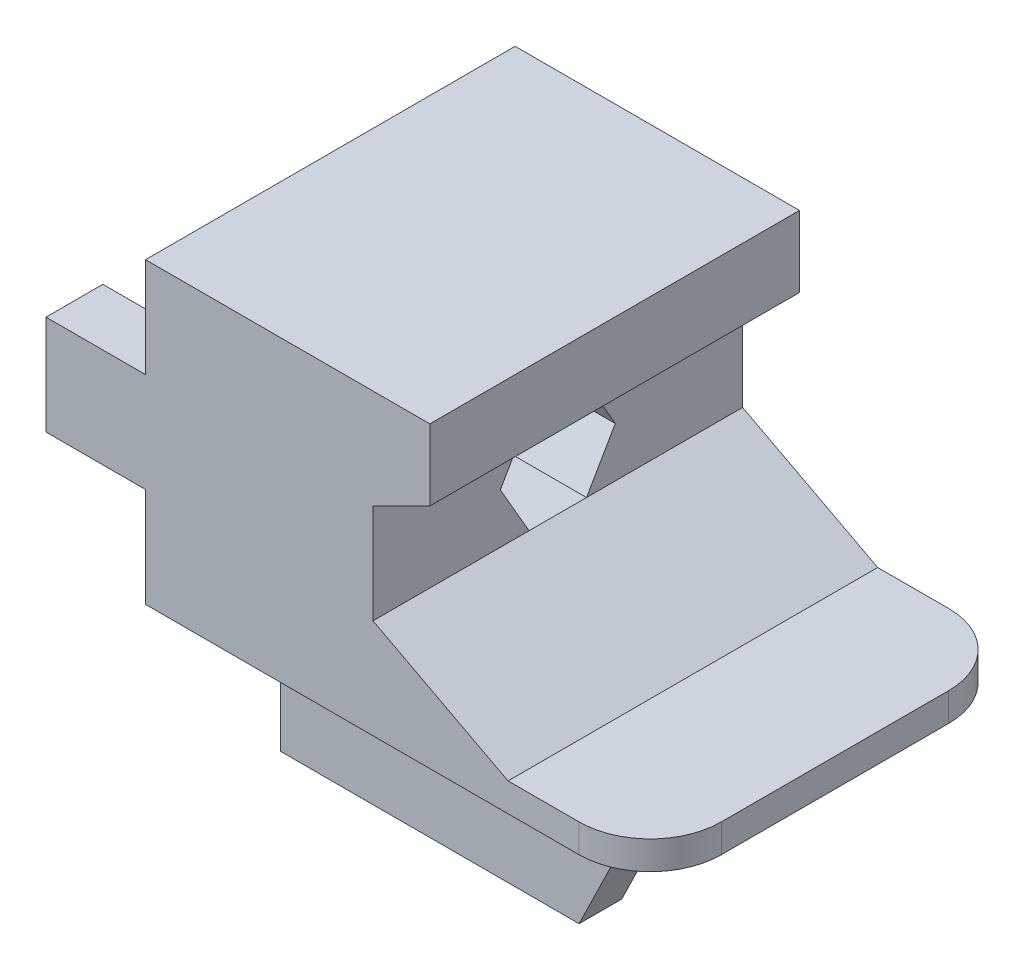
from build123d import *

# Parameters (mm, degrees)
BOSS_EXTRU_1_DEPTH      = 26
ESQUISSE2_W             = 25
ESQUISSE2_H             = 3
BOSS_EXTRU_2_DEPTH      = 8.2
ENL_V_MAT_EXTRU_1_DEPTH = 47.746657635
ESQUISSE4_W             = 26
ESQUISSE4_H             = 7
BOSS_EXTRU_3_DEPTH      = 7
ESQUISSE5_W             = 18
ESQUISSE5_H             = 15
ENL_V_MAT_EXTRU_2_DEPTH = 5
ESQUISSE6_R             = 2
ENL_V_MAT_EXTRU_3_DEPTH = 41.57092555
ENL_V_MAT_EXTRU_4_DEPTH = 7
CONG_1_R                = 5


with BuildPart() as part:
    # Esquisse1 → Boss.-Extru.1 (new body)
    with BuildSketch(Plane.XY):
        Polygon((25.5, 2), (35.5, 2), (35.5, 0), (0, 0), (0, 21), (20, 21), (20, 16), (16, 14), (16, 7), align=None)
    extrude(amount=BOSS_EXTRU_1_DEPTH)

    # Esquisse2 → Boss.-Extru.2 (add)
    with BuildSketch(Plane.XZ):
        with Locations((18, 20.5)):
            Rectangle(ESQUISSE2_W, ESQUISSE2_H)
        with Locations((18, 5.5)):
            Rectangle(ESQUISSE2_W, ESQUISSE2_H)
    extrude(amount=BOSS_EXTRU_2_DEPTH)

    # Esquisse3 → Enl_v. mat.-Extru.1 (cut, through all)
    with BuildSketch(Plane(origin=(0, 0, 4), x_dir=(-1, 0, 0), z_dir=(0, 0, -1))):
        Polygon((-30.5, 0), (-26.5, -8.2), (-30.5, -8.2), align=None)
    extrude(amount=-ENL_V_MAT_EXTRU_1_DEPTH, mode=Mode.SUBTRACT)

    # Esquisse4 → Boss.-Extru.3 (add)
    with BuildSketch(Plane.ZY):
        with Locations((13, 10.5)):
            Rectangle(ESQUISSE4_W, ESQUISSE4_H)
    extrude(amount=BOSS_EXTRU_3_DEPTH)

    # Esquisse5 → Enl_v. mat.-Extru.2 (cut)
    with BuildSketch(Plane.ZY.offset(7)):
        with Locations((13, 10.559717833)):
            Rectangle(ESQUISSE5_W, ESQUISSE5_H)
    extrude(amount=-ENL_V_MAT_EXTRU_2_DEPTH, mode=Mode.SUBTRACT)

    # Esquisse6 → Enl_v. mat.-Extru.3 (cut, through all)
    with BuildSketch(Plane(origin=(16, 0, 0), x_dir=(0, 0, -1), z_dir=(1, 0, 0))):
        with Locations((-13, 10.5)):
            Circle(ESQUISSE6_R)
    extrude(amount=-ENL_V_MAT_EXTRU_3_DEPTH, mode=Mode.SUBTRACT)

    # Esquisse7 → Enl_v. mat.-Extru.4 (cut)
    with BuildSketch(Plane(origin=(16, 0, 0), x_dir=(0, 0, -1), z_dir=(1, 0, 0))):
        Polygon((-8.958548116, 10.5), (-10.979274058, 14), (-15.020725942, 14), (-17.041451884, 10.5), (-15.020725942, 7), (-10.979274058, 7), align=None)
    extrude(amount=-ENL_V_MAT_EXTRU_4_DEPTH, mode=Mode.SUBTRACT)

    # Cong_1
    cong_1_edges = [part.edges().sort_by_distance(p)[0] for p in [
        (35.5, 1, 26),
        (35.5, 1, 0),
    ]]
    fillet(cong_1_edges, radius=CONG_1_R)


solid = part.part
